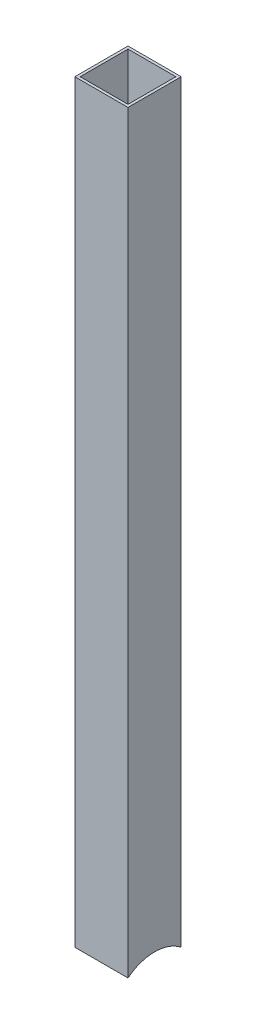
from build123d import *

# Parameters (mm, degrees)
SKETCH1_W           = 50
SKETCH1_H           = 50
BOSS_EXTRUDE1_DEPTH = 740
SHELL1_T            = -2.5
SKETCH2_R           = 40
CUT_EXTRUDE1_DEPTH  = 743.108482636


with BuildPart() as part:
    # Sketch1 → Boss-Extrude1 (new body)
    with BuildSketch(Plane(origin=(0, 0, 0), x_dir=(1, 0, 0), z_dir=(0, 1, 0))):
        Rectangle(SKETCH1_W, SKETCH1_H)
    extrude(amount=BOSS_EXTRUDE1_DEPTH)

    # Shell1
    shell1_openings = [part.faces().sort_by_distance(p)[0] for p in [
        (0, 740, 0),
        (0, 0, 0),
    ]]
    offset(amount=SHELL1_T, openings=shell1_openings, kind=Kind.INTERSECTION)

    # Sketch2 → Cut-Extrude1 (cut, through all)
    with BuildSketch(Plane.ZY.offset(25)):
        Circle(SKETCH2_R)
    extrude(amount=-CUT_EXTRUDE1_DEPTH, mode=Mode.SUBTRACT)


solid = part.part
